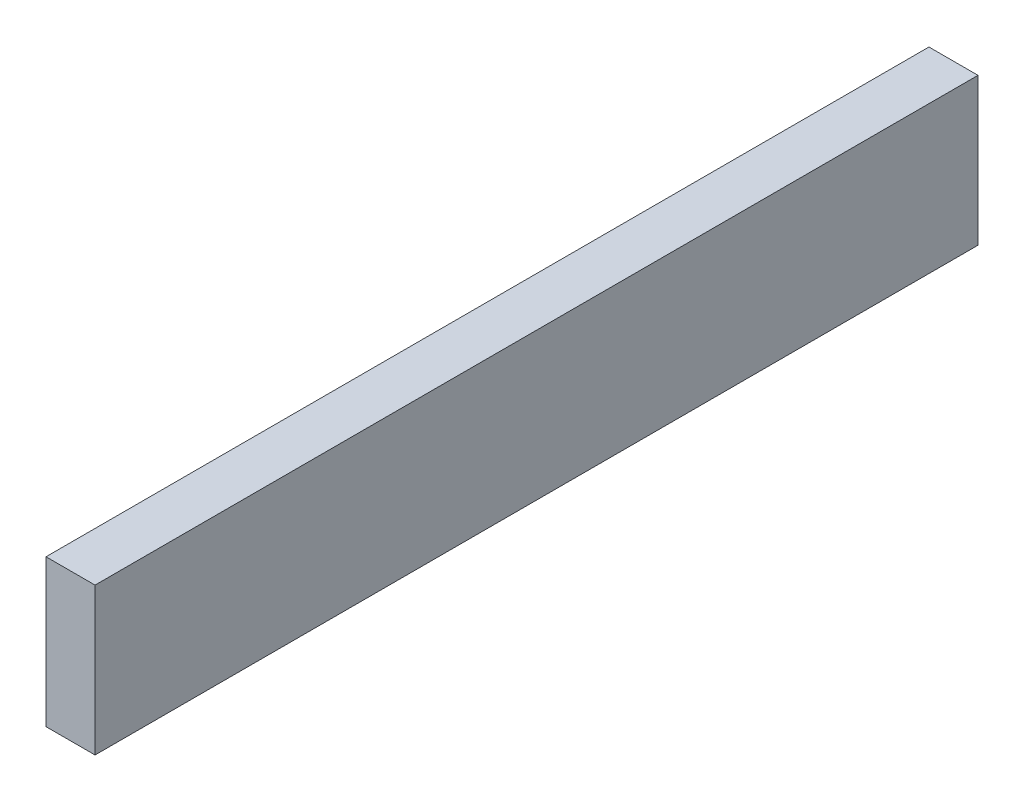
from build123d import *

# Parameters (mm, degrees)
BOSS_EXTRUDE1_DEPTH      = 50
BOSS_EXTRUDE1_DEPTH_BACK = 50
SKETCH1_W                = 300
SKETCH1_H                = 1800


with BuildPart() as part:
    # Sketch1 → Boss-Extrude1 (new, two sides: drawn at the far end of the back side and taken through both)
    with BuildSketch(Plane.YZ.offset(-BOSS_EXTRUDE1_DEPTH_BACK)):
        with Locations((150, 0)):
            Rectangle(SKETCH1_W, SKETCH1_H)
    extrude(amount=BOSS_EXTRUDE1_DEPTH + BOSS_EXTRUDE1_DEPTH_BACK)


solid = part.part
